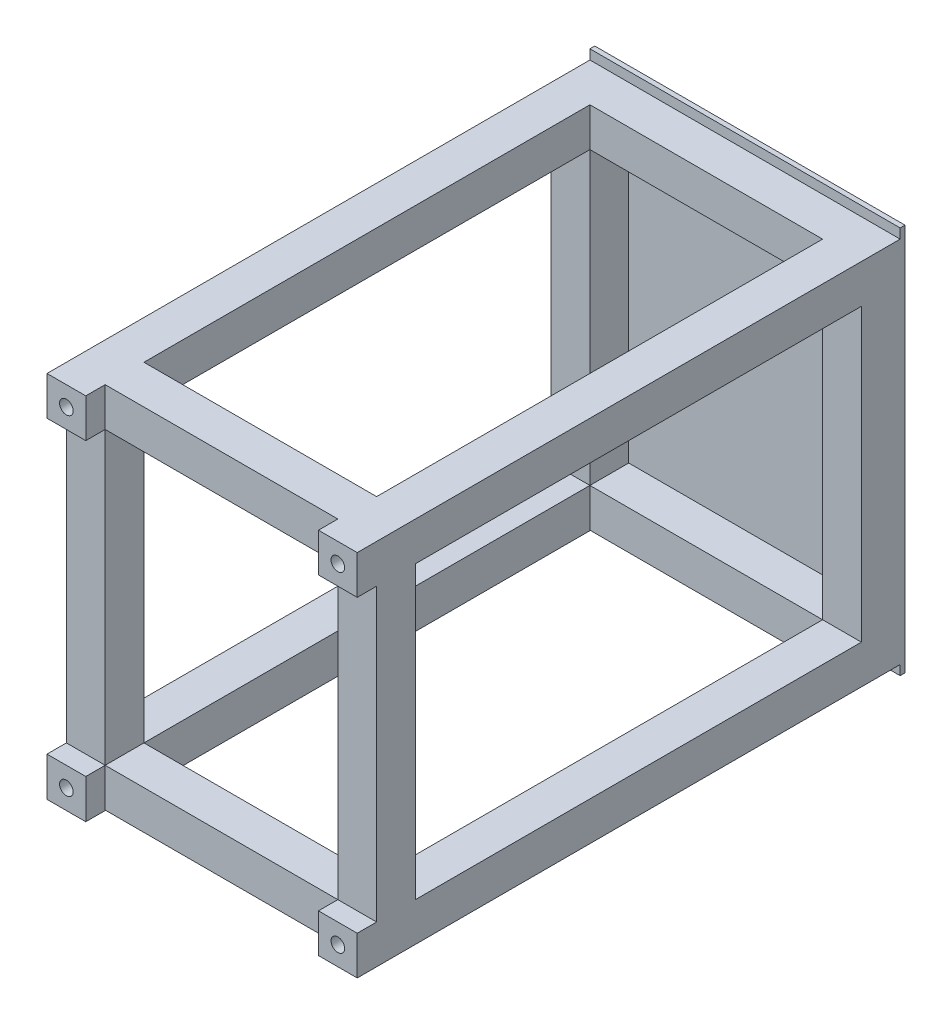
ISO-10303-21;
HEADER;
FILE_DESCRIPTION(('STEP AP214'),'2;1');
FILE_NAME('part.step','',(''),(''),'','','');
FILE_SCHEMA(('AUTOMOTIVE_DESIGN { 1 0 10303 214 1 1 1 1 }'));
ENDSEC;
DATA;
#1=APPLICATION_CONTEXT('core data for automotive mechanical design processes');
#2=APPLICATION_PROTOCOL_DEFINITION('international standard','automotive_design',2000,#1);
#3=PRODUCT_CONTEXT('',#1,'mechanical');
#4=PRODUCT('Part','Part','',(#3));
#5=PRODUCT_RELATED_PRODUCT_CATEGORY('part','',(#4));
#6=PRODUCT_DEFINITION_FORMATION('','',#4);
#7=PRODUCT_DEFINITION_CONTEXT('part definition',#1,'design');
#8=PRODUCT_DEFINITION('design','',#6,#7);
#9=PRODUCT_DEFINITION_SHAPE('','',#8);
#10=(LENGTH_UNIT() NAMED_UNIT(*) SI_UNIT(.MILLI.,.METRE.));
#11=(NAMED_UNIT(*) PLANE_ANGLE_UNIT() SI_UNIT($,.RADIAN.));
#12=(NAMED_UNIT(*) SI_UNIT($,.STERADIAN.) SOLID_ANGLE_UNIT());
#13=UNCERTAINTY_MEASURE_WITH_UNIT(LENGTH_MEASURE(1.E-05),#10,'distance_accuracy_value','');
#14=(GEOMETRIC_REPRESENTATION_CONTEXT(3) GLOBAL_UNCERTAINTY_ASSIGNED_CONTEXT((#13)) GLOBAL_UNIT_ASSIGNED_CONTEXT((#10,
#11,#12)) REPRESENTATION_CONTEXT('',''));
#15=CARTESIAN_POINT('',(0.,0.,0.));
#16=DIRECTION('',(0.,0.,1.));
#17=DIRECTION('',(1.,0.,0.));
#18=AXIS2_PLACEMENT_3D('',#15,#16,#17);
#19=CARTESIAN_POINT('',(-160.,150.,565.));
#20=DIRECTION('',(0.,1.,0.));
#21=DIRECTION('',(-1.,0.,0.));
#22=AXIS2_PLACEMENT_3D('',#19,#20,#21);
#23=PLANE('',#22);
#24=DIRECTION('',(-1.,0.,0.));
#25=VECTOR('',#24,1.);
#26=CARTESIAN_POINT('',(-160.,150.,545.));
#27=LINE('',#26,#25);
#28=CARTESIAN_POINT('',(-120.,150.,545.));
#29=VERTEX_POINT('',#28);
#30=CARTESIAN_POINT('',(-160.,150.,545.));
#31=VERTEX_POINT('',#30);
#32=EDGE_CURVE('E328',#29,#31,#27,.T.);
#33=ORIENTED_EDGE('',*,*,#32,.F.);
#34=DIRECTION('',(0.,0.,-1.));
#35=VECTOR('',#34,1.);
#36=CARTESIAN_POINT('',(-120.,150.,565.));
#37=LINE('',#36,#35);
#38=CARTESIAN_POINT('',(-120.,150.,565.));
#39=VERTEX_POINT('',#38);
#40=EDGE_CURVE('E497',#39,#29,#37,.T.);
#41=ORIENTED_EDGE('',*,*,#40,.F.);
#42=DIRECTION('',(1.,0.,0.));
#43=VECTOR('',#42,1.);
#44=CARTESIAN_POINT('',(-160.,150.,565.));
#45=LINE('',#44,#43);
#46=CARTESIAN_POINT('',(-160.,150.,565.));
#47=VERTEX_POINT('',#46);
#48=EDGE_CURVE('E486',#47,#39,#45,.T.);
#49=ORIENTED_EDGE('',*,*,#48,.F.);
#50=DIRECTION('',(0.,0.,-1.));
#51=VECTOR('',#50,1.);
#52=CARTESIAN_POINT('',(-160.,150.,565.));
#53=LINE('',#52,#51);
#54=EDGE_CURVE('E662',#47,#31,#53,.T.);
#55=ORIENTED_EDGE('',*,*,#54,.T.);
#56=EDGE_LOOP('',(#33,#41,#49,#55));
#57=FACE_BOUND('',#56,.T.);
#58=ADVANCED_FACE('F39',(#57),#23,.F.);
#59=DIRECTION('',(0.,0.,1.));
#60=VECTOR('',#59,1.);
#61=CARTESIAN_POINT('',(-120.,150.,565.));
#62=LINE('',#61,#60);
#63=CARTESIAN_POINT('',(-120.,150.,505.));
#64=VERTEX_POINT('',#63);
#65=EDGE_CURVE('E324',#64,#29,#62,.T.);
#66=ORIENTED_EDGE('',*,*,#65,.F.);
#67=DIRECTION('',(1.,0.,0.));
#68=VECTOR('',#67,1.);
#69=CARTESIAN_POINT('',(-120.,150.,505.));
#70=LINE('',#69,#68);
#71=CARTESIAN_POINT('',(120.,150.,505.));
#72=VERTEX_POINT('',#71);
#73=EDGE_CURVE('E398',#64,#72,#70,.T.);
#74=ORIENTED_EDGE('',*,*,#73,.T.);
#75=DIRECTION('',(0.,0.,-1.));
#76=VECTOR('',#75,1.);
#77=CARTESIAN_POINT('',(120.,150.,565.));
#78=LINE('',#77,#76);
#79=CARTESIAN_POINT('',(120.,150.,545.));
#80=VERTEX_POINT('',#79);
#81=EDGE_CURVE('E350',#80,#72,#78,.T.);
#82=ORIENTED_EDGE('',*,*,#81,.F.);
#83=DIRECTION('',(1.,0.,0.));
#84=VECTOR('',#83,1.);
#85=CARTESIAN_POINT('',(-120.,150.,545.));
#86=LINE('',#85,#84);
#87=EDGE_CURVE('E386',#29,#80,#86,.T.);
#88=ORIENTED_EDGE('',*,*,#87,.F.);
#89=EDGE_LOOP('',(#66,#74,#82,#88));
#90=FACE_BOUND('',#89,.T.);
#91=ADVANCED_FACE('F707',(#90),#23,.F.);
#92=CARTESIAN_POINT('',(120.,-150.,565.));
#93=DIRECTION('',(0.,-1.,0.));
#94=DIRECTION('',(0.,0.,-1.));
#95=AXIS2_PLACEMENT_3D('',#92,#93,#94);
#96=PLANE('',#95);
#97=DIRECTION('',(1.,0.,0.));
#98=VECTOR('',#97,1.);
#99=CARTESIAN_POINT('',(120.,-150.,545.));
#100=LINE('',#99,#98);
#101=CARTESIAN_POINT('',(-160.,-150.,545.));
#102=VERTEX_POINT('',#101);
#103=CARTESIAN_POINT('',(-120.,-150.,545.));
#104=VERTEX_POINT('',#103);
#105=EDGE_CURVE('E326',#102,#104,#100,.T.);
#106=ORIENTED_EDGE('',*,*,#105,.F.);
#107=DIRECTION('',(0.,0.,-1.));
#108=VECTOR('',#107,1.);
#109=CARTESIAN_POINT('',(-160.,-150.,565.));
#110=LINE('',#109,#108);
#111=CARTESIAN_POINT('',(-160.,-150.,565.));
#112=VERTEX_POINT('',#111);
#113=EDGE_CURVE('E422',#112,#102,#110,.T.);
#114=ORIENTED_EDGE('',*,*,#113,.F.);
#115=DIRECTION('',(-1.,0.,0.));
#116=VECTOR('',#115,1.);
#117=CARTESIAN_POINT('',(-160.,-150.,565.));
#118=LINE('',#117,#116);
#119=CARTESIAN_POINT('',(-120.,-150.,565.));
#120=VERTEX_POINT('',#119);
#121=EDGE_CURVE('E415',#120,#112,#118,.T.);
#122=ORIENTED_EDGE('',*,*,#121,.F.);
#123=DIRECTION('',(0.,0.,-1.));
#124=VECTOR('',#123,1.);
#125=CARTESIAN_POINT('',(-120.,-150.,565.));
#126=LINE('',#125,#124);
#127=EDGE_CURVE('E426',#120,#104,#126,.T.);
#128=ORIENTED_EDGE('',*,*,#127,.T.);
#129=EDGE_LOOP('',(#106,#114,#122,#128));
#130=FACE_BOUND('',#129,.T.);
#131=ADVANCED_FACE('F657',(#130),#96,.F.);
#132=DIRECTION('',(0.,0.,-1.));
#133=VECTOR('',#132,1.);
#134=CARTESIAN_POINT('',(-120.,-150.,565.));
#135=LINE('',#134,#133);
#136=CARTESIAN_POINT('',(-120.,-150.,505.));
#137=VERTEX_POINT('',#136);
#138=EDGE_CURVE('E318',#104,#137,#135,.T.);
#139=ORIENTED_EDGE('',*,*,#138,.F.);
#140=DIRECTION('',(-1.,0.,0.));
#141=VECTOR('',#140,1.);
#142=CARTESIAN_POINT('',(-120.,-150.,545.));
#143=LINE('',#142,#141);
#144=CARTESIAN_POINT('',(120.,-150.,545.));
#145=VERTEX_POINT('',#144);
#146=EDGE_CURVE('E365',#145,#104,#143,.T.);
#147=ORIENTED_EDGE('',*,*,#146,.F.);
#148=DIRECTION('',(0.,0.,1.));
#149=VECTOR('',#148,1.);
#150=CARTESIAN_POINT('',(120.,-150.,565.));
#151=LINE('',#150,#149);
#152=CARTESIAN_POINT('',(120.,-150.,505.));
#153=VERTEX_POINT('',#152);
#154=EDGE_CURVE('E343',#153,#145,#151,.T.);
#155=ORIENTED_EDGE('',*,*,#154,.F.);
#156=DIRECTION('',(-1.,0.,0.));
#157=VECTOR('',#156,1.);
#158=CARTESIAN_POINT('',(-120.,-150.,505.));
#159=LINE('',#158,#157);
#160=EDGE_CURVE('E376',#153,#137,#159,.T.);
#161=ORIENTED_EDGE('',*,*,#160,.T.);
#162=EDGE_LOOP('',(#139,#147,#155,#161));
#163=FACE_BOUND('',#162,.T.);
#164=ADVANCED_FACE('F705',(#163),#96,.F.);
#165=CARTESIAN_POINT('',(-120.,150.,45.));
#166=VERTEX_POINT('',#165);
#167=EDGE_CURVE('E507',#64,#166,#37,.T.);
#168=ORIENTED_EDGE('',*,*,#167,.F.);
#169=DIRECTION('',(-1.,0.,0.));
#170=VECTOR('',#169,1.);
#171=CARTESIAN_POINT('',(-160.,150.,505.));
#172=LINE('',#171,#170);
#173=CARTESIAN_POINT('',(-160.,150.,505.));
#174=VERTEX_POINT('',#173);
#175=EDGE_CURVE('E333',#64,#174,#172,.T.);
#176=ORIENTED_EDGE('',*,*,#175,.T.);
#177=CARTESIAN_POINT('',(-160.,150.,45.));
#178=VERTEX_POINT('',#177);
#179=EDGE_CURVE('E43',#174,#178,#53,.T.);
#180=ORIENTED_EDGE('',*,*,#179,.T.);
#181=DIRECTION('',(1.,0.,0.));
#182=VECTOR('',#181,1.);
#183=CARTESIAN_POINT('',(-160.,150.,45.));
#184=LINE('',#183,#182);
#185=EDGE_CURVE('E482',#178,#166,#184,.T.);
#186=ORIENTED_EDGE('',*,*,#185,.T.);
#187=EDGE_LOOP('',(#168,#176,#180,#186));
#188=FACE_BOUND('',#187,.T.);
#189=ADVANCED_FACE('F702',(#188),#23,.F.);
#190=DIRECTION('',(1.,0.,0.));
#191=VECTOR('',#190,1.);
#192=CARTESIAN_POINT('',(-160.,150.,505.));
#193=LINE('',#192,#191);
#194=CARTESIAN_POINT('',(160.,150.,505.));
#195=VERTEX_POINT('',#194);
#196=EDGE_CURVE('E353',#72,#195,#193,.T.);
#197=ORIENTED_EDGE('',*,*,#196,.F.);
#198=DIRECTION('',(0.,0.,-1.));
#199=VECTOR('',#198,1.);
#200=CARTESIAN_POINT('',(120.,150.,565.));
#201=LINE('',#200,#199);
#202=CARTESIAN_POINT('',(120.,150.,45.));
#203=VERTEX_POINT('',#202);
#204=EDGE_CURVE('E479',#72,#203,#201,.T.);
#205=ORIENTED_EDGE('',*,*,#204,.T.);
#206=DIRECTION('',(1.,0.,0.));
#207=VECTOR('',#206,1.);
#208=CARTESIAN_POINT('',(120.,150.,45.));
#209=LINE('',#208,#207);
#210=CARTESIAN_POINT('',(160.,150.,45.));
#211=VERTEX_POINT('',#210);
#212=EDGE_CURVE('E461',#203,#211,#209,.T.);
#213=ORIENTED_EDGE('',*,*,#212,.T.);
#214=DIRECTION('',(0.,0.,-1.));
#215=VECTOR('',#214,1.);
#216=CARTESIAN_POINT('',(160.,150.,565.));
#217=LINE('',#216,#215);
#218=EDGE_CURVE('E476',#195,#211,#217,.T.);
#219=ORIENTED_EDGE('',*,*,#218,.F.);
#220=EDGE_LOOP('',(#197,#205,#213,#219));
#221=FACE_BOUND('',#220,.T.);
#222=ADVANCED_FACE('F704',(#221),#23,.F.);
#223=CARTESIAN_POINT('',(-160.,-150.,505.));
#224=VERTEX_POINT('',#223);
#225=CARTESIAN_POINT('',(-160.,-150.,45.));
#226=VERTEX_POINT('',#225);
#227=EDGE_CURVE('E417',#224,#226,#110,.T.);
#228=ORIENTED_EDGE('',*,*,#227,.F.);
#229=DIRECTION('',(1.,0.,0.));
#230=VECTOR('',#229,1.);
#231=CARTESIAN_POINT('',(120.,-150.,505.));
#232=LINE('',#231,#230);
#233=EDGE_CURVE('E330',#224,#137,#232,.T.);
#234=ORIENTED_EDGE('',*,*,#233,.T.);
#235=CARTESIAN_POINT('',(-120.,-150.,45.));
#236=VERTEX_POINT('',#235);
#237=EDGE_CURVE('E425',#137,#236,#126,.T.);
#238=ORIENTED_EDGE('',*,*,#237,.T.);
#239=DIRECTION('',(-1.,0.,0.));
#240=VECTOR('',#239,1.);
#241=CARTESIAN_POINT('',(-160.,-150.,45.));
#242=LINE('',#241,#240);
#243=EDGE_CURVE('E410',#236,#226,#242,.T.);
#244=ORIENTED_EDGE('',*,*,#243,.T.);
#245=EDGE_LOOP('',(#228,#234,#238,#244));
#246=FACE_BOUND('',#245,.T.);
#247=ADVANCED_FACE('F712',(#246),#96,.F.);
#248=DIRECTION('',(-1.,0.,0.));
#249=VECTOR('',#248,1.);
#250=CARTESIAN_POINT('',(120.,-150.,505.));
#251=LINE('',#250,#249);
#252=CARTESIAN_POINT('',(160.,-150.,505.));
#253=VERTEX_POINT('',#252);
#254=EDGE_CURVE('E49',#253,#153,#251,.T.);
#255=ORIENTED_EDGE('',*,*,#254,.F.);
#256=DIRECTION('',(0.,0.,-1.));
#257=VECTOR('',#256,1.);
#258=CARTESIAN_POINT('',(160.,-150.,565.));
#259=LINE('',#258,#257);
#260=CARTESIAN_POINT('',(160.,-150.,45.));
#261=VERTEX_POINT('',#260);
#262=EDGE_CURVE('E449',#253,#261,#259,.T.);
#263=ORIENTED_EDGE('',*,*,#262,.T.);
#264=DIRECTION('',(-1.,0.,0.));
#265=VECTOR('',#264,1.);
#266=CARTESIAN_POINT('',(120.,-150.,45.));
#267=LINE('',#266,#265);
#268=CARTESIAN_POINT('',(120.,-150.,45.));
#269=VERTEX_POINT('',#268);
#270=EDGE_CURVE('E434',#261,#269,#267,.T.);
#271=ORIENTED_EDGE('',*,*,#270,.T.);
#272=DIRECTION('',(0.,0.,-1.));
#273=VECTOR('',#272,1.);
#274=CARTESIAN_POINT('',(120.,-150.,565.));
#275=LINE('',#274,#273);
#276=EDGE_CURVE('E441',#153,#269,#275,.T.);
#277=ORIENTED_EDGE('',*,*,#276,.F.);
#278=EDGE_LOOP('',(#255,#263,#271,#277));
#279=FACE_BOUND('',#278,.T.);
#280=ADVANCED_FACE('F765',(#279),#96,.F.);
#281=CARTESIAN_POINT('',(120.,-150.,565.));
#282=DIRECTION('',(1.,0.,0.));
#283=DIRECTION('',(0.,1.,0.));
#284=AXIS2_PLACEMENT_3D('',#281,#282,#283);
#285=PLANE('',#284);
#286=DIRECTION('',(0.,1.,0.));
#287=VECTOR('',#286,1.);
#288=CARTESIAN_POINT('',(120.,-190.,505.));
#289=LINE('',#288,#287);
#290=CARTESIAN_POINT('',(120.,-190.,505.));
#291=VERTEX_POINT('',#290);
#292=EDGE_CURVE('E373',#291,#153,#289,.T.);
#293=ORIENTED_EDGE('',*,*,#292,.T.);
#294=ORIENTED_EDGE('',*,*,#276,.T.);
#295=DIRECTION('',(0.,-1.,0.));
#296=VECTOR('',#295,1.);
#297=CARTESIAN_POINT('',(120.,-150.,45.));
#298=LINE('',#297,#296);
#299=CARTESIAN_POINT('',(120.,-190.,45.));
#300=VERTEX_POINT('',#299);
#301=EDGE_CURVE('E429',#269,#300,#298,.T.);
#302=ORIENTED_EDGE('',*,*,#301,.T.);
#303=DIRECTION('',(0.,0.,-1.));
#304=VECTOR('',#303,1.);
#305=CARTESIAN_POINT('',(120.,-190.,565.));
#306=LINE('',#305,#304);
#307=EDGE_CURVE('E452',#291,#300,#306,.T.);
#308=ORIENTED_EDGE('',*,*,#307,.F.);
#309=EDGE_LOOP('',(#293,#294,#302,#308));
#310=FACE_BOUND('',#309,.T.);
#311=ADVANCED_FACE('F762',(#310),#285,.F.);
#312=CARTESIAN_POINT('',(-120.,190.,565.));
#313=DIRECTION('',(-1.,0.,0.));
#314=DIRECTION('',(0.,0.,1.));
#315=AXIS2_PLACEMENT_3D('',#312,#313,#314);
#316=PLANE('',#315);
#317=DIRECTION('',(0.,-1.,0.));
#318=VECTOR('',#317,1.);
#319=CARTESIAN_POINT('',(-120.,190.,505.));
#320=LINE('',#319,#318);
#321=CARTESIAN_POINT('',(-120.,190.,505.));
#322=VERTEX_POINT('',#321);
#323=EDGE_CURVE('E382',#322,#64,#320,.T.);
#324=ORIENTED_EDGE('',*,*,#323,.T.);
#325=ORIENTED_EDGE('',*,*,#167,.T.);
#326=DIRECTION('',(0.,1.,0.));
#327=VECTOR('',#326,1.);
#328=CARTESIAN_POINT('',(-120.,190.,45.));
#329=LINE('',#328,#327);
#330=CARTESIAN_POINT('',(-120.,190.,45.));
#331=VERTEX_POINT('',#330);
#332=EDGE_CURVE('E487',#166,#331,#329,.T.);
#333=ORIENTED_EDGE('',*,*,#332,.T.);
#334=DIRECTION('',(0.,0.,-1.));
#335=VECTOR('',#334,1.);
#336=CARTESIAN_POINT('',(-120.,190.,565.));
#337=LINE('',#336,#335);
#338=EDGE_CURVE('E494',#322,#331,#337,.T.);
#339=ORIENTED_EDGE('',*,*,#338,.F.);
#340=EDGE_LOOP('',(#324,#325,#333,#339));
#341=FACE_BOUND('',#340,.T.);
#342=ADVANCED_FACE('F679',(#341),#316,.F.);
#343=CARTESIAN_POINT('',(120.,150.,565.));
#344=DIRECTION('',(1.,0.,0.));
#345=DIRECTION('',(0.,0.,-1.));
#346=AXIS2_PLACEMENT_3D('',#343,#344,#345);
#347=PLANE('',#346);
#348=DIRECTION('',(0.,1.,0.));
#349=VECTOR('',#348,1.);
#350=CARTESIAN_POINT('',(120.,190.,505.));
#351=LINE('',#350,#349);
#352=CARTESIAN_POINT('',(120.,190.,505.));
#353=VERTEX_POINT('',#352);
#354=EDGE_CURVE('E401',#72,#353,#351,.T.);
#355=ORIENTED_EDGE('',*,*,#354,.T.);
#356=DIRECTION('',(0.,0.,-1.));
#357=VECTOR('',#356,1.);
#358=CARTESIAN_POINT('',(120.,190.,565.));
#359=LINE('',#358,#357);
#360=CARTESIAN_POINT('',(120.,190.,45.));
#361=VERTEX_POINT('',#360);
#362=EDGE_CURVE('E468',#353,#361,#359,.T.);
#363=ORIENTED_EDGE('',*,*,#362,.T.);
#364=DIRECTION('',(0.,-1.,0.));
#365=VECTOR('',#364,1.);
#366=CARTESIAN_POINT('',(120.,150.,45.));
#367=LINE('',#366,#365);
#368=EDGE_CURVE('E456',#361,#203,#367,.T.);
#369=ORIENTED_EDGE('',*,*,#368,.T.);
#370=ORIENTED_EDGE('',*,*,#204,.F.);
#371=EDGE_LOOP('',(#355,#363,#369,#370));
#372=FACE_BOUND('',#371,.T.);
#373=ADVANCED_FACE('F820',(#372),#347,.F.);
#374=CARTESIAN_POINT('',(0.,0.,45.));
#375=DIRECTION('',(0.,0.,1.));
#376=DIRECTION('',(1.,0.,0.));
#377=AXIS2_PLACEMENT_3D('',#374,#375,#376);
#378=PLANE('',#377);
#379=DIRECTION('',(-1.,0.,0.));
#380=VECTOR('',#379,1.);
#381=CARTESIAN_POINT('',(-120.,-150.,45.));
#382=LINE('',#381,#380);
#383=EDGE_CURVE('E568',#269,#236,#382,.T.);
#384=ORIENTED_EDGE('',*,*,#383,.T.);
#385=DIRECTION('',(0.,1.,0.));
#386=VECTOR('',#385,1.);
#387=CARTESIAN_POINT('',(-120.,-190.450216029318,45.));
#388=LINE('',#387,#386);
#389=CARTESIAN_POINT('',(-120.,-190.,45.));
#390=VERTEX_POINT('',#389);
#391=EDGE_CURVE('E395',#390,#236,#388,.T.);
#392=ORIENTED_EDGE('',*,*,#391,.F.);
#393=DIRECTION('',(1.,0.,0.));
#394=VECTOR('',#393,1.);
#395=CARTESIAN_POINT('',(-120.,-190.,45.));
#396=LINE('',#395,#394);
#397=EDGE_CURVE('E565',#390,#300,#396,.T.);
#398=ORIENTED_EDGE('',*,*,#397,.T.);
#399=ORIENTED_EDGE('',*,*,#301,.F.);
#400=EDGE_LOOP('',(#384,#392,#398,#399));
#401=FACE_BOUND('',#400,.T.);
#402=ADVANCED_FACE('F860',(#401),#378,.T.);
#403=DIRECTION('',(0.,-1.,0.));
#404=VECTOR('',#403,1.);
#405=CARTESIAN_POINT('',(-160.,190.,45.));
#406=LINE('',#405,#404);
#407=EDGE_CURVE('E532',#178,#226,#406,.T.);
#408=ORIENTED_EDGE('',*,*,#407,.T.);
#409=ORIENTED_EDGE('',*,*,#243,.F.);
#410=DIRECTION('',(0.,1.,0.));
#411=VECTOR('',#410,1.);
#412=CARTESIAN_POINT('',(-120.,190.,45.));
#413=LINE('',#412,#411);
#414=EDGE_CURVE('E537',#236,#166,#413,.T.);
#415=ORIENTED_EDGE('',*,*,#414,.T.);
#416=ORIENTED_EDGE('',*,*,#185,.F.);
#417=EDGE_LOOP('',(#408,#409,#415,#416));
#418=FACE_BOUND('',#417,.T.);
#419=ADVANCED_FACE('F694',(#418),#378,.T.);
#420=DIRECTION('',(0.,-1.,0.));
#421=VECTOR('',#420,1.);
#422=CARTESIAN_POINT('',(120.,190.,45.));
#423=LINE('',#422,#421);
#424=EDGE_CURVE('E553',#203,#269,#423,.T.);
#425=ORIENTED_EDGE('',*,*,#424,.T.);
#426=ORIENTED_EDGE('',*,*,#270,.F.);
#427=DIRECTION('',(0.,1.,0.));
#428=VECTOR('',#427,1.);
#429=CARTESIAN_POINT('',(160.,190.,45.));
#430=LINE('',#429,#428);
#431=EDGE_CURVE('E556',#261,#211,#430,.T.);
#432=ORIENTED_EDGE('',*,*,#431,.T.);
#433=ORIENTED_EDGE('',*,*,#212,.F.);
#434=EDGE_LOOP('',(#425,#426,#432,#433));
#435=FACE_BOUND('',#434,.T.);
#436=ADVANCED_FACE('F770',(#435),#378,.T.);
#437=DIRECTION('',(1.,0.,0.));
#438=VECTOR('',#437,1.);
#439=CARTESIAN_POINT('',(-120.,150.,45.));
#440=LINE('',#439,#438);
#441=EDGE_CURVE('E585',#166,#203,#440,.T.);
#442=ORIENTED_EDGE('',*,*,#441,.T.);
#443=ORIENTED_EDGE('',*,*,#368,.F.);
#444=DIRECTION('',(-1.,0.,0.));
#445=VECTOR('',#444,1.);
#446=CARTESIAN_POINT('',(-120.,190.,45.));
#447=LINE('',#446,#445);
#448=EDGE_CURVE('E510',#361,#331,#447,.T.);
#449=ORIENTED_EDGE('',*,*,#448,.T.);
#450=ORIENTED_EDGE('',*,*,#332,.F.);
#451=EDGE_LOOP('',(#442,#443,#449,#450));
#452=FACE_BOUND('',#451,.T.);
#453=ADVANCED_FACE('F700',(#452),#378,.T.);
#454=CARTESIAN_POINT('',(0.,0.,5.));
#455=DIRECTION('',(0.,0.,1.));
#456=DIRECTION('',(1.,0.,0.));
#457=AXIS2_PLACEMENT_3D('',#454,#455,#456);
#458=PLANE('',#457);
#459=DIRECTION('',(1.,0.,0.));
#460=VECTOR('',#459,1.);
#461=CARTESIAN_POINT('',(-120.,150.,5.));
#462=LINE('',#461,#460);
#463=CARTESIAN_POINT('',(-120.,150.,5.));
#464=VERTEX_POINT('',#463);
#465=CARTESIAN_POINT('',(120.,150.,5.));
#466=VERTEX_POINT('',#465);
#467=EDGE_CURVE('E584',#464,#466,#462,.T.);
#468=ORIENTED_EDGE('',*,*,#467,.F.);
#469=DIRECTION('',(0.,1.,0.));
#470=VECTOR('',#469,1.);
#471=CARTESIAN_POINT('',(-120.,190.,5.));
#472=LINE('',#471,#470);
#473=CARTESIAN_POINT('',(-120.,-150.,5.));
#474=VERTEX_POINT('',#473);
#475=EDGE_CURVE('E544',#474,#464,#472,.T.);
#476=ORIENTED_EDGE('',*,*,#475,.F.);
#477=DIRECTION('',(-1.,0.,0.));
#478=VECTOR('',#477,1.);
#479=CARTESIAN_POINT('',(-120.,-150.,5.));
#480=LINE('',#479,#478);
#481=CARTESIAN_POINT('',(120.,-150.,5.));
#482=VERTEX_POINT('',#481);
#483=EDGE_CURVE('E569',#482,#474,#480,.T.);
#484=ORIENTED_EDGE('',*,*,#483,.F.);
#485=DIRECTION('',(0.,-1.,0.));
#486=VECTOR('',#485,1.);
#487=CARTESIAN_POINT('',(120.,190.,5.));
#488=LINE('',#487,#486);
#489=EDGE_CURVE('E552',#466,#482,#488,.T.);
#490=ORIENTED_EDGE('',*,*,#489,.F.);
#491=EDGE_LOOP('',(#468,#476,#484,#490));
#492=FACE_BOUND('',#491,.T.);
#493=ADVANCED_FACE('F849',(#492),#458,.T.);
#494=DIRECTION('',(0.,-1.,0.));
#495=VECTOR('',#494,1.);
#496=CARTESIAN_POINT('',(-160.,200.,5.));
#497=LINE('',#496,#495);
#498=CARTESIAN_POINT('',(-160.,200.,5.));
#499=VERTEX_POINT('',#498);
#500=CARTESIAN_POINT('',(-160.,190.,5.));
#501=VERTEX_POINT('',#500);
#502=EDGE_CURVE('E607',#499,#501,#497,.T.);
#503=ORIENTED_EDGE('',*,*,#502,.T.);
#504=DIRECTION('',(-1.,0.,0.));
#505=VECTOR('',#504,1.);
#506=CARTESIAN_POINT('',(-120.,190.,5.));
#507=LINE('',#506,#505);
#508=CARTESIAN_POINT('',(160.,190.,5.));
#509=VERTEX_POINT('',#508);
#510=EDGE_CURVE('E587',#509,#501,#507,.T.);
#511=ORIENTED_EDGE('',*,*,#510,.F.);
#512=DIRECTION('',(0.,1.,0.));
#513=VECTOR('',#512,1.);
#514=CARTESIAN_POINT('',(160.,200.,5.));
#515=LINE('',#514,#513);
#516=CARTESIAN_POINT('',(160.,200.,5.));
#517=VERTEX_POINT('',#516);
#518=EDGE_CURVE('E604',#509,#517,#515,.T.);
#519=ORIENTED_EDGE('',*,*,#518,.T.);
#520=DIRECTION('',(-1.,0.,0.));
#521=VECTOR('',#520,1.);
#522=CARTESIAN_POINT('',(-160.,200.,5.));
#523=LINE('',#522,#521);
#524=EDGE_CURVE('E603',#517,#499,#523,.T.);
#525=ORIENTED_EDGE('',*,*,#524,.T.);
#526=EDGE_LOOP('',(#503,#511,#519,#525));
#527=FACE_BOUND('',#526,.T.);
#528=ADVANCED_FACE('F834',(#527),#458,.T.);
#529=DIRECTION('',(1.,0.,0.));
#530=VECTOR('',#529,1.);
#531=CARTESIAN_POINT('',(-120.,-190.,5.));
#532=LINE('',#531,#530);
#533=CARTESIAN_POINT('',(-120.,-190.,5.));
#534=VERTEX_POINT('',#533);
#535=CARTESIAN_POINT('',(160.,-190.,5.));
#536=VERTEX_POINT('',#535);
#537=EDGE_CURVE('E564',#534,#536,#532,.T.);
#538=ORIENTED_EDGE('',*,*,#537,.F.);
#539=CARTESIAN_POINT('',(-120.,-190.450216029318,5.));
#540=VERTEX_POINT('',#539);
#541=EDGE_CURVE('E541',#540,#534,#472,.T.);
#542=ORIENTED_EDGE('',*,*,#541,.F.);
#543=DIRECTION('',(1.,0.,0.));
#544=VECTOR('',#543,1.);
#545=CARTESIAN_POINT('',(-120.,-190.450216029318,5.));
#546=LINE('',#545,#544);
#547=CARTESIAN_POINT('',(-160.,-190.450216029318,5.));
#548=VERTEX_POINT('',#547);
#549=EDGE_CURVE('E543',#548,#540,#546,.T.);
#550=ORIENTED_EDGE('',*,*,#549,.F.);
#551=CARTESIAN_POINT('',(-160.,-200.,5.));
#552=VERTEX_POINT('',#551);
#553=EDGE_CURVE('E606',#548,#552,#497,.T.);
#554=ORIENTED_EDGE('',*,*,#553,.T.);
#555=DIRECTION('',(1.,0.,0.));
#556=VECTOR('',#555,1.);
#557=CARTESIAN_POINT('',(-160.,-200.,5.));
#558=LINE('',#557,#556);
#559=CARTESIAN_POINT('',(160.,-200.,5.));
#560=VERTEX_POINT('',#559);
#561=EDGE_CURVE('E610',#552,#560,#558,.T.);
#562=ORIENTED_EDGE('',*,*,#561,.T.);
#563=EDGE_CURVE('E600',#560,#536,#515,.T.);
#564=ORIENTED_EDGE('',*,*,#563,.T.);
#565=EDGE_LOOP('',(#538,#542,#550,#554,#562,#564));
#566=FACE_BOUND('',#565,.T.);
#567=ADVANCED_FACE('F641',(#566),#458,.T.);
#568=CARTESIAN_POINT('',(160.,200.,5.));
#569=DIRECTION('',(-1.,0.,0.));
#570=DIRECTION('',(0.,-1.,0.));
#571=AXIS2_PLACEMENT_3D('',#568,#569,#570);
#572=PLANE('',#571);
#573=CARTESIAN_POINT('',(160.,150.,565.));
#574=VERTEX_POINT('',#573);
#575=CARTESIAN_POINT('',(160.,150.,545.));
#576=VERTEX_POINT('',#575);
#577=EDGE_CURVE('E477',#574,#576,#217,.T.);
#578=ORIENTED_EDGE('',*,*,#577,.T.);
#579=DIRECTION('',(0.,1.,0.));
#580=VECTOR('',#579,1.);
#581=CARTESIAN_POINT('',(160.,190.,545.));
#582=LINE('',#581,#580);
#583=CARTESIAN_POINT('',(160.,-150.,545.));
#584=VERTEX_POINT('',#583);
#585=EDGE_CURVE('E339',#584,#576,#582,.T.);
#586=ORIENTED_EDGE('',*,*,#585,.F.);
#587=CARTESIAN_POINT('',(160.,-150.,565.));
#588=VERTEX_POINT('',#587);
#589=EDGE_CURVE('E450',#588,#584,#259,.T.);
#590=ORIENTED_EDGE('',*,*,#589,.F.);
#591=DIRECTION('',(0.,1.,0.));
#592=VECTOR('',#591,1.);
#593=CARTESIAN_POINT('',(160.,-150.,565.));
#594=LINE('',#593,#592);
#595=CARTESIAN_POINT('',(160.,-190.,565.));
#596=VERTEX_POINT('',#595);
#597=EDGE_CURVE('E437',#596,#588,#594,.T.);
#598=ORIENTED_EDGE('',*,*,#597,.F.);
#599=DIRECTION('',(0.,0.,-1.));
#600=VECTOR('',#599,1.);
#601=CARTESIAN_POINT('',(160.,-190.,45.));
#602=LINE('',#601,#600);
#603=EDGE_CURVE('E562',#596,#536,#602,.T.);
#604=ORIENTED_EDGE('',*,*,#603,.T.);
#605=ORIENTED_EDGE('',*,*,#563,.F.);
#606=DIRECTION('',(0.,0.,-1.));
#607=VECTOR('',#606,1.);
#608=CARTESIAN_POINT('',(160.,-200.,5.));
#609=LINE('',#608,#607);
#610=CARTESIAN_POINT('',(160.,-200.,0.));
#611=VERTEX_POINT('',#610);
#612=EDGE_CURVE('E612',#560,#611,#609,.T.);
#613=ORIENTED_EDGE('',*,*,#612,.T.);
#614=DIRECTION('',(0.,1.,0.));
#615=VECTOR('',#614,1.);
#616=CARTESIAN_POINT('',(160.,200.,0.));
#617=LINE('',#616,#615);
#618=CARTESIAN_POINT('',(160.,200.,0.));
#619=VERTEX_POINT('',#618);
#620=EDGE_CURVE('E599',#611,#619,#617,.T.);
#621=ORIENTED_EDGE('',*,*,#620,.T.);
#622=DIRECTION('',(0.,0.,-1.));
#623=VECTOR('',#622,1.);
#624=CARTESIAN_POINT('',(160.,200.,5.));
#625=LINE('',#624,#623);
#626=EDGE_CURVE('E516',#517,#619,#625,.T.);
#627=ORIENTED_EDGE('',*,*,#626,.F.);
#628=ORIENTED_EDGE('',*,*,#518,.F.);
#629=DIRECTION('',(0.,0.,-1.));
#630=VECTOR('',#629,1.);
#631=CARTESIAN_POINT('',(160.,190.,45.));
#632=LINE('',#631,#630);
#633=CARTESIAN_POINT('',(160.,190.,565.));
#634=VERTEX_POINT('',#633);
#635=EDGE_CURVE('E559',#634,#509,#632,.T.);
#636=ORIENTED_EDGE('',*,*,#635,.F.);
#637=DIRECTION('',(0.,1.,0.));
#638=VECTOR('',#637,1.);
#639=CARTESIAN_POINT('',(160.,150.,565.));
#640=LINE('',#639,#638);
#641=EDGE_CURVE('E463',#574,#634,#640,.T.);
#642=ORIENTED_EDGE('',*,*,#641,.F.);
#643=EDGE_LOOP('',(#578,#586,#590,#598,#604,#605,#613,#621,#627,#628,#636,#642));
#644=FACE_BOUND('',#643,.T.);
#645=ORIENTED_EDGE('',*,*,#262,.F.);
#646=DIRECTION('',(0.,1.,0.));
#647=VECTOR('',#646,1.);
#648=CARTESIAN_POINT('',(160.,190.,505.));
#649=LINE('',#648,#647);
#650=EDGE_CURVE('E340',#253,#195,#649,.T.);
#651=ORIENTED_EDGE('',*,*,#650,.T.);
#652=ORIENTED_EDGE('',*,*,#218,.T.);
#653=ORIENTED_EDGE('',*,*,#431,.F.);
#654=EDGE_LOOP('',(#645,#651,#652,#653));
#655=FACE_BOUND('',#654,.T.);
#656=ADVANCED_FACE('F41',(#644,#655),#572,.F.);
#657=CARTESIAN_POINT('',(-160.,200.,5.));
#658=DIRECTION('',(0.,-1.,0.));
#659=DIRECTION('',(0.,0.,-1.));
#660=AXIS2_PLACEMENT_3D('',#657,#658,#659);
#661=PLANE('',#660);
#662=DIRECTION('',(-1.,0.,0.));
#663=VECTOR('',#662,1.);
#664=CARTESIAN_POINT('',(-160.,200.,0.));
#665=LINE('',#664,#663);
#666=CARTESIAN_POINT('',(-160.,200.,0.));
#667=VERTEX_POINT('',#666);
#668=EDGE_CURVE('E614',#619,#667,#665,.T.);
#669=ORIENTED_EDGE('',*,*,#668,.T.);
#670=DIRECTION('',(0.,0.,-1.));
#671=VECTOR('',#670,1.);
#672=CARTESIAN_POINT('',(-160.,200.,5.));
#673=LINE('',#672,#671);
#674=EDGE_CURVE('E521',#499,#667,#673,.T.);
#675=ORIENTED_EDGE('',*,*,#674,.F.);
#676=ORIENTED_EDGE('',*,*,#524,.F.);
#677=ORIENTED_EDGE('',*,*,#626,.T.);
#678=EDGE_LOOP('',(#669,#675,#676,#677));
#679=FACE_BOUND('',#678,.T.);
#680=ADVANCED_FACE('F836',(#679),#661,.F.);
#681=CARTESIAN_POINT('',(-160.,200.,5.));
#682=DIRECTION('',(1.,0.,0.));
#683=DIRECTION('',(0.,1.,0.));
#684=AXIS2_PLACEMENT_3D('',#681,#682,#683);
#685=PLANE('',#684);
#686=ORIENTED_EDGE('',*,*,#179,.F.);
#687=DIRECTION('',(0.,-1.,0.));
#688=VECTOR('',#687,1.);
#689=CARTESIAN_POINT('',(-160.,190.,505.));
#690=LINE('',#689,#688);
#691=EDGE_CURVE('E56',#174,#224,#690,.T.);
#692=ORIENTED_EDGE('',*,*,#691,.T.);
#693=ORIENTED_EDGE('',*,*,#227,.T.);
#694=ORIENTED_EDGE('',*,*,#407,.F.);
#695=EDGE_LOOP('',(#686,#692,#693,#694));
#696=FACE_BOUND('',#695,.T.);
#697=ORIENTED_EDGE('',*,*,#553,.F.);
#698=DIRECTION('',(0.,0.,-1.));
#699=VECTOR('',#698,1.);
#700=CARTESIAN_POINT('',(-160.,-190.450216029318,45.));
#701=LINE('',#700,#699);
#702=CARTESIAN_POINT('',(-160.,-190.450216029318,565.));
#703=VERTEX_POINT('',#702);
#704=EDGE_CURVE('E548',#703,#548,#701,.T.);
#705=ORIENTED_EDGE('',*,*,#704,.F.);
#706=DIRECTION('',(0.,-1.,0.));
#707=VECTOR('',#706,1.);
#708=CARTESIAN_POINT('',(-160.,-190.450216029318,565.));
#709=LINE('',#708,#707);
#710=EDGE_CURVE('E406',#112,#703,#709,.T.);
#711=ORIENTED_EDGE('',*,*,#710,.F.);
#712=ORIENTED_EDGE('',*,*,#113,.T.);
#713=DIRECTION('',(0.,-1.,0.));
#714=VECTOR('',#713,1.);
#715=CARTESIAN_POINT('',(-160.,190.,545.));
#716=LINE('',#715,#714);
#717=EDGE_CURVE('E316',#31,#102,#716,.T.);
#718=ORIENTED_EDGE('',*,*,#717,.F.);
#719=ORIENTED_EDGE('',*,*,#54,.F.);
#720=DIRECTION('',(0.,-1.,0.));
#721=VECTOR('',#720,1.);
#722=CARTESIAN_POINT('',(-160.,190.,565.));
#723=LINE('',#722,#721);
#724=CARTESIAN_POINT('',(-160.,190.,565.));
#725=VERTEX_POINT('',#724);
#726=EDGE_CURVE('E483',#725,#47,#723,.T.);
#727=ORIENTED_EDGE('',*,*,#726,.F.);
#728=DIRECTION('',(0.,0.,-1.));
#729=VECTOR('',#728,1.);
#730=CARTESIAN_POINT('',(-160.,190.,45.));
#731=LINE('',#730,#729);
#732=EDGE_CURVE('E550',#725,#501,#731,.T.);
#733=ORIENTED_EDGE('',*,*,#732,.T.);
#734=ORIENTED_EDGE('',*,*,#502,.F.);
#735=ORIENTED_EDGE('',*,*,#674,.T.);
#736=DIRECTION('',(0.,-1.,0.));
#737=VECTOR('',#736,1.);
#738=CARTESIAN_POINT('',(-160.,200.,0.));
#739=LINE('',#738,#737);
#740=CARTESIAN_POINT('',(-160.,-200.,0.));
#741=VERTEX_POINT('',#740);
#742=EDGE_CURVE('E616',#667,#741,#739,.T.);
#743=ORIENTED_EDGE('',*,*,#742,.T.);
#744=DIRECTION('',(0.,0.,-1.));
#745=VECTOR('',#744,1.);
#746=CARTESIAN_POINT('',(-160.,-200.,5.));
#747=LINE('',#746,#745);
#748=EDGE_CURVE('E528',#552,#741,#747,.T.);
#749=ORIENTED_EDGE('',*,*,#748,.F.);
#750=EDGE_LOOP('',(#697,#705,#711,#712,#718,#719,#727,#733,#734,#735,#743,#749));
#751=FACE_BOUND('',#750,.T.);
#752=ADVANCED_FACE('F644',(#696,#751),#685,.F.);
#753=CARTESIAN_POINT('',(-160.,-200.,5.));
#754=DIRECTION('',(0.,1.,0.));
#755=DIRECTION('',(0.,0.,1.));
#756=AXIS2_PLACEMENT_3D('',#753,#754,#755);
#757=PLANE('',#756);
#758=DIRECTION('',(1.,0.,0.));
#759=VECTOR('',#758,1.);
#760=CARTESIAN_POINT('',(-160.,-200.,0.));
#761=LINE('',#760,#759);
#762=EDGE_CURVE('E618',#741,#611,#761,.T.);
#763=ORIENTED_EDGE('',*,*,#762,.T.);
#764=ORIENTED_EDGE('',*,*,#612,.F.);
#765=ORIENTED_EDGE('',*,*,#561,.F.);
#766=ORIENTED_EDGE('',*,*,#748,.T.);
#767=EDGE_LOOP('',(#763,#764,#765,#766));
#768=FACE_BOUND('',#767,.T.);
#769=ADVANCED_FACE('F626',(#768),#757,.F.);
#770=CARTESIAN_POINT('',(0.,0.,0.));
#771=DIRECTION('',(0.,0.,1.));
#772=DIRECTION('',(1.,0.,0.));
#773=AXIS2_PLACEMENT_3D('',#770,#771,#772);
#774=PLANE('',#773);
#775=ORIENTED_EDGE('',*,*,#620,.F.);
#776=ORIENTED_EDGE('',*,*,#762,.F.);
#777=ORIENTED_EDGE('',*,*,#742,.F.);
#778=ORIENTED_EDGE('',*,*,#668,.F.);
#779=EDGE_LOOP('',(#775,#776,#777,#778));
#780=FACE_BOUND('',#779,.T.);
#781=ADVANCED_FACE('F633',(#780),#774,.F.);
#782=CARTESIAN_POINT('',(-120.,150.,45.));
#783=DIRECTION('',(0.,1.,0.));
#784=DIRECTION('',(-1.,0.,0.));
#785=AXIS2_PLACEMENT_3D('',#782,#783,#784);
#786=PLANE('',#785);
#787=ORIENTED_EDGE('',*,*,#467,.T.);
#788=DIRECTION('',(0.,0.,-1.));
#789=VECTOR('',#788,1.);
#790=CARTESIAN_POINT('',(120.,150.,45.));
#791=LINE('',#790,#789);
#792=EDGE_CURVE('E594',#203,#466,#791,.T.);
#793=ORIENTED_EDGE('',*,*,#792,.F.);
#794=ORIENTED_EDGE('',*,*,#441,.F.);
#795=DIRECTION('',(0.,0.,-1.));
#796=VECTOR('',#795,1.);
#797=CARTESIAN_POINT('',(-120.,150.,45.));
#798=LINE('',#797,#796);
#799=EDGE_CURVE('E596',#166,#464,#798,.T.);
#800=ORIENTED_EDGE('',*,*,#799,.T.);
#801=EDGE_LOOP('',(#787,#793,#794,#800));
#802=FACE_BOUND('',#801,.T.);
#803=ADVANCED_FACE('F686',(#802),#786,.F.);
#804=CARTESIAN_POINT('',(-120.,190.,45.));
#805=DIRECTION('',(0.,-1.,0.));
#806=DIRECTION('',(0.,0.,-1.));
#807=AXIS2_PLACEMENT_3D('',#804,#805,#806);
#808=PLANE('',#807);
#809=DIRECTION('',(-1.,0.,0.));
#810=VECTOR('',#809,1.);
#811=CARTESIAN_POINT('',(-120.,190.,505.));
#812=LINE('',#811,#810);
#813=EDGE_CURVE('E387',#353,#322,#812,.T.);
#814=ORIENTED_EDGE('',*,*,#813,.T.);
#815=ORIENTED_EDGE('',*,*,#338,.T.);
#816=ORIENTED_EDGE('',*,*,#448,.F.);
#817=ORIENTED_EDGE('',*,*,#362,.F.);
#818=EDGE_LOOP('',(#814,#815,#816,#817));
#819=FACE_BOUND('',#818,.T.);
#820=ORIENTED_EDGE('',*,*,#510,.T.);
#821=ORIENTED_EDGE('',*,*,#732,.F.);
#822=DIRECTION('',(-1.,0.,0.));
#823=VECTOR('',#822,1.);
#824=CARTESIAN_POINT('',(-160.,190.,565.));
#825=LINE('',#824,#823);
#826=CARTESIAN_POINT('',(-120.,190.,565.));
#827=VERTEX_POINT('',#826);
#828=EDGE_CURVE('E491',#827,#725,#825,.T.);
#829=ORIENTED_EDGE('',*,*,#828,.F.);
#830=CARTESIAN_POINT('',(-120.,190.,545.));
#831=VERTEX_POINT('',#830);
#832=EDGE_CURVE('E504',#827,#831,#337,.T.);
#833=ORIENTED_EDGE('',*,*,#832,.T.);
#834=DIRECTION('',(-1.,0.,0.));
#835=VECTOR('',#834,1.);
#836=CARTESIAN_POINT('',(-120.,190.,545.));
#837=LINE('',#836,#835);
#838=CARTESIAN_POINT('',(120.,190.,545.));
#839=VERTEX_POINT('',#838);
#840=EDGE_CURVE('E392',#839,#831,#837,.T.);
#841=ORIENTED_EDGE('',*,*,#840,.F.);
#842=CARTESIAN_POINT('',(120.,190.,565.));
#843=VERTEX_POINT('',#842);
#844=EDGE_CURVE('E473',#843,#839,#359,.T.);
#845=ORIENTED_EDGE('',*,*,#844,.F.);
#846=DIRECTION('',(-1.,0.,0.));
#847=VECTOR('',#846,1.);
#848=CARTESIAN_POINT('',(120.,190.,565.));
#849=LINE('',#848,#847);
#850=EDGE_CURVE('E466',#634,#843,#849,.T.);
#851=ORIENTED_EDGE('',*,*,#850,.F.);
#852=ORIENTED_EDGE('',*,*,#635,.T.);
#853=EDGE_LOOP('',(#820,#821,#829,#833,#841,#845,#851,#852));
#854=FACE_BOUND('',#853,.T.);
#855=ADVANCED_FACE('F831',(#819,#854),#808,.F.);
#856=CARTESIAN_POINT('',(-120.,-190.,45.));
#857=DIRECTION('',(0.,1.,0.));
#858=DIRECTION('',(0.,0.,1.));
#859=AXIS2_PLACEMENT_3D('',#856,#857,#858);
#860=PLANE('',#859);
#861=CARTESIAN_POINT('',(120.,-190.,565.));
#862=VERTEX_POINT('',#861);
#863=CARTESIAN_POINT('',(120.,-190.,545.));
#864=VERTEX_POINT('',#863);
#865=EDGE_CURVE('E453',#862,#864,#306,.T.);
#866=ORIENTED_EDGE('',*,*,#865,.T.);
#867=DIRECTION('',(1.,0.,0.));
#868=VECTOR('',#867,1.);
#869=CARTESIAN_POINT('',(-120.,-190.,545.));
#870=LINE('',#869,#868);
#871=CARTESIAN_POINT('',(-120.,-190.,545.));
#872=VERTEX_POINT('',#871);
#873=EDGE_CURVE('E358',#872,#864,#870,.T.);
#874=ORIENTED_EDGE('',*,*,#873,.F.);
#875=DIRECTION('',(0.,0.,-1.));
#876=VECTOR('',#875,1.);
#877=CARTESIAN_POINT('',(-120.,-190.,545.));
#878=LINE('',#877,#876);
#879=CARTESIAN_POINT('',(-120.,-190.,505.));
#880=VERTEX_POINT('',#879);
#881=EDGE_CURVE('E370',#872,#880,#878,.T.);
#882=ORIENTED_EDGE('',*,*,#881,.T.);
#883=DIRECTION('',(1.,0.,0.));
#884=VECTOR('',#883,1.);
#885=CARTESIAN_POINT('',(-120.,-190.,505.));
#886=LINE('',#885,#884);
#887=EDGE_CURVE('E357',#880,#291,#886,.T.);
#888=ORIENTED_EDGE('',*,*,#887,.T.);
#889=ORIENTED_EDGE('',*,*,#307,.T.);
#890=ORIENTED_EDGE('',*,*,#397,.F.);
#891=DIRECTION('',(0.,0.,-1.));
#892=VECTOR('',#891,1.);
#893=CARTESIAN_POINT('',(-120.,-190.,45.));
#894=LINE('',#893,#892);
#895=EDGE_CURVE('E572',#390,#534,#894,.T.);
#896=ORIENTED_EDGE('',*,*,#895,.T.);
#897=ORIENTED_EDGE('',*,*,#537,.T.);
#898=ORIENTED_EDGE('',*,*,#603,.F.);
#899=DIRECTION('',(1.,0.,0.));
#900=VECTOR('',#899,1.);
#901=CARTESIAN_POINT('',(120.,-190.,565.));
#902=LINE('',#901,#900);
#903=EDGE_CURVE('E433',#862,#596,#902,.T.);
#904=ORIENTED_EDGE('',*,*,#903,.F.);
#905=EDGE_LOOP('',(#866,#874,#882,#888,#889,#890,#896,#897,#898,#904));
#906=FACE_BOUND('',#905,.T.);
#907=ADVANCED_FACE('F756',(#906),#860,.F.);
#908=CARTESIAN_POINT('',(-120.,-150.,45.));
#909=DIRECTION('',(0.,-1.,0.));
#910=DIRECTION('',(1.,0.,0.));
#911=AXIS2_PLACEMENT_3D('',#908,#909,#910);
#912=PLANE('',#911);
#913=ORIENTED_EDGE('',*,*,#483,.T.);
#914=DIRECTION('',(0.,0.,-1.));
#915=VECTOR('',#914,1.);
#916=CARTESIAN_POINT('',(-120.,-150.,45.));
#917=LINE('',#916,#915);
#918=EDGE_CURVE('E579',#236,#474,#917,.T.);
#919=ORIENTED_EDGE('',*,*,#918,.F.);
#920=ORIENTED_EDGE('',*,*,#383,.F.);
#921=DIRECTION('',(0.,0.,-1.));
#922=VECTOR('',#921,1.);
#923=CARTESIAN_POINT('',(120.,-150.,45.));
#924=LINE('',#923,#922);
#925=EDGE_CURVE('E581',#269,#482,#924,.T.);
#926=ORIENTED_EDGE('',*,*,#925,.T.);
#927=EDGE_LOOP('',(#913,#919,#920,#926));
#928=FACE_BOUND('',#927,.T.);
#929=ADVANCED_FACE('F863',(#928),#912,.F.);
#930=CARTESIAN_POINT('',(120.,190.,45.));
#931=DIRECTION('',(1.,0.,0.));
#932=DIRECTION('',(0.,1.,0.));
#933=AXIS2_PLACEMENT_3D('',#930,#931,#932);
#934=PLANE('',#933);
#935=ORIENTED_EDGE('',*,*,#424,.F.);
#936=ORIENTED_EDGE('',*,*,#792,.T.);
#937=ORIENTED_EDGE('',*,*,#489,.T.);
#938=ORIENTED_EDGE('',*,*,#925,.F.);
#939=EDGE_LOOP('',(#935,#936,#937,#938));
#940=FACE_BOUND('',#939,.T.);
#941=ADVANCED_FACE('F866',(#940),#934,.F.);
#942=CARTESIAN_POINT('',(-120.,190.,45.));
#943=DIRECTION('',(-1.,0.,0.));
#944=DIRECTION('',(0.,-1.,0.));
#945=AXIS2_PLACEMENT_3D('',#942,#943,#944);
#946=PLANE('',#945);
#947=ORIENTED_EDGE('',*,*,#475,.T.);
#948=ORIENTED_EDGE('',*,*,#799,.F.);
#949=ORIENTED_EDGE('',*,*,#414,.F.);
#950=ORIENTED_EDGE('',*,*,#918,.T.);
#951=EDGE_LOOP('',(#947,#948,#949,#950));
#952=FACE_BOUND('',#951,.T.);
#953=ADVANCED_FACE('F697',(#952),#946,.F.);
#954=DIRECTION('',(0.,-1.,0.));
#955=VECTOR('',#954,1.);
#956=CARTESIAN_POINT('',(-120.,-190.,505.));
#957=LINE('',#956,#955);
#958=EDGE_CURVE('E362',#137,#880,#957,.T.);
#959=ORIENTED_EDGE('',*,*,#958,.T.);
#960=ORIENTED_EDGE('',*,*,#881,.F.);
#961=DIRECTION('',(0.,-1.,0.));
#962=VECTOR('',#961,1.);
#963=CARTESIAN_POINT('',(-120.,-190.,545.));
#964=LINE('',#963,#962);
#965=EDGE_CURVE('E368',#104,#872,#964,.T.);
#966=ORIENTED_EDGE('',*,*,#965,.F.);
#967=ORIENTED_EDGE('',*,*,#127,.F.);
#968=DIRECTION('',(0.,1.,0.));
#969=VECTOR('',#968,1.);
#970=CARTESIAN_POINT('',(-120.,-190.450216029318,565.));
#971=LINE('',#970,#969);
#972=CARTESIAN_POINT('',(-120.,-190.450216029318,565.));
#973=VERTEX_POINT('',#972);
#974=EDGE_CURVE('E413',#973,#120,#971,.T.);
#975=ORIENTED_EDGE('',*,*,#974,.F.);
#976=DIRECTION('',(0.,0.,-1.));
#977=VECTOR('',#976,1.);
#978=CARTESIAN_POINT('',(-120.,-190.450216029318,45.));
#979=LINE('',#978,#977);
#980=EDGE_CURVE('E536',#973,#540,#979,.T.);
#981=ORIENTED_EDGE('',*,*,#980,.T.);
#982=ORIENTED_EDGE('',*,*,#541,.T.);
#983=ORIENTED_EDGE('',*,*,#895,.F.);
#984=ORIENTED_EDGE('',*,*,#391,.T.);
#985=ORIENTED_EDGE('',*,*,#237,.F.);
#986=EDGE_LOOP('',(#959,#960,#966,#967,#975,#981,#982,#983,#984,#985));
#987=FACE_BOUND('',#986,.T.);
#988=ADVANCED_FACE('F731',(#987),#946,.F.);
#989=CARTESIAN_POINT('',(-120.,-190.450216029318,45.));
#990=DIRECTION('',(0.,1.,0.));
#991=DIRECTION('',(0.,0.,1.));
#992=AXIS2_PLACEMENT_3D('',#989,#990,#991);
#993=PLANE('',#992);
#994=ORIENTED_EDGE('',*,*,#549,.T.);
#995=ORIENTED_EDGE('',*,*,#980,.F.);
#996=DIRECTION('',(1.,0.,0.));
#997=VECTOR('',#996,1.);
#998=CARTESIAN_POINT('',(-160.,-190.450216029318,565.));
#999=LINE('',#998,#997);
#1000=EDGE_CURVE('E409',#703,#973,#999,.T.);
#1001=ORIENTED_EDGE('',*,*,#1000,.F.);
#1002=ORIENTED_EDGE('',*,*,#704,.T.);
#1003=EDGE_LOOP('',(#994,#995,#1001,#1002));
#1004=FACE_BOUND('',#1003,.T.);
#1005=ADVANCED_FACE('F648',(#1004),#993,.F.);
#1006=CARTESIAN_POINT('',(120.,150.,565.));
#1007=VERTEX_POINT('',#1006);
#1008=EDGE_CURVE('E480',#1007,#80,#201,.T.);
#1009=ORIENTED_EDGE('',*,*,#1008,.T.);
#1010=DIRECTION('',(1.,0.,0.));
#1011=VECTOR('',#1010,1.);
#1012=CARTESIAN_POINT('',(-160.,150.,545.));
#1013=LINE('',#1012,#1011);
#1014=EDGE_CURVE('E64',#80,#576,#1013,.T.);
#1015=ORIENTED_EDGE('',*,*,#1014,.T.);
#1016=ORIENTED_EDGE('',*,*,#577,.F.);
#1017=DIRECTION('',(1.,0.,0.));
#1018=VECTOR('',#1017,1.);
#1019=CARTESIAN_POINT('',(120.,150.,565.));
#1020=LINE('',#1019,#1018);
#1021=EDGE_CURVE('E460',#1007,#574,#1020,.T.);
#1022=ORIENTED_EDGE('',*,*,#1021,.F.);
#1023=EDGE_LOOP('',(#1009,#1015,#1016,#1022));
#1024=FACE_BOUND('',#1023,.T.);
#1025=ADVANCED_FACE('F714',(#1024),#23,.F.);
#1026=ORIENTED_EDGE('',*,*,#40,.T.);
#1027=DIRECTION('',(0.,-1.,0.));
#1028=VECTOR('',#1027,1.);
#1029=CARTESIAN_POINT('',(-120.,190.,545.));
#1030=LINE('',#1029,#1028);
#1031=EDGE_CURVE('E383',#831,#29,#1030,.T.);
#1032=ORIENTED_EDGE('',*,*,#1031,.F.);
#1033=ORIENTED_EDGE('',*,*,#832,.F.);
#1034=DIRECTION('',(0.,1.,0.));
#1035=VECTOR('',#1034,1.);
#1036=CARTESIAN_POINT('',(-120.,190.,565.));
#1037=LINE('',#1036,#1035);
#1038=EDGE_CURVE('E489',#39,#827,#1037,.T.);
#1039=ORIENTED_EDGE('',*,*,#1038,.F.);
#1040=EDGE_LOOP('',(#1026,#1032,#1033,#1039));
#1041=FACE_BOUND('',#1040,.T.);
#1042=ADVANCED_FACE('F725',(#1041),#316,.F.);
#1043=CARTESIAN_POINT('',(0.,0.,565.));
#1044=DIRECTION('',(0.,0.,1.));
#1045=DIRECTION('',(1.,0.,0.));
#1046=AXIS2_PLACEMENT_3D('',#1043,#1044,#1045);
#1047=PLANE('',#1046);
#1048=CARTESIAN_POINT('',(-140.,170.,565.));
#1049=DIRECTION('',(0.,0.,1.));
#1050=DIRECTION('',(1.,0.,0.));
#1051=AXIS2_PLACEMENT_3D('',#1048,#1049,#1050);
#1052=CIRCLE('',#1051,6.99999999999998);
#1053=CARTESIAN_POINT('',(-133.,170.,565.));
#1054=VERTEX_POINT('',#1053);
#1055=EDGE_CURVE('E290',#1054,#1054,#1052,.T.);
#1056=ORIENTED_EDGE('',*,*,#1055,.F.);
#1057=EDGE_LOOP('',(#1056));
#1058=FACE_BOUND('',#1057,.T.);
#1059=ORIENTED_EDGE('',*,*,#726,.T.);
#1060=ORIENTED_EDGE('',*,*,#48,.T.);
#1061=ORIENTED_EDGE('',*,*,#1038,.T.);
#1062=ORIENTED_EDGE('',*,*,#828,.T.);
#1063=EDGE_LOOP('',(#1059,#1060,#1061,#1062));
#1064=FACE_BOUND('',#1063,.T.);
#1065=ADVANCED_FACE('F730',(#1058,#1064),#1047,.T.);
#1066=ORIENTED_EDGE('',*,*,#844,.T.);
#1067=DIRECTION('',(0.,1.,0.));
#1068=VECTOR('',#1067,1.);
#1069=CARTESIAN_POINT('',(120.,190.,545.));
#1070=LINE('',#1069,#1068);
#1071=EDGE_CURVE('E390',#80,#839,#1070,.T.);
#1072=ORIENTED_EDGE('',*,*,#1071,.F.);
#1073=ORIENTED_EDGE('',*,*,#1008,.F.);
#1074=DIRECTION('',(0.,-1.,0.));
#1075=VECTOR('',#1074,1.);
#1076=CARTESIAN_POINT('',(120.,150.,565.));
#1077=LINE('',#1076,#1075);
#1078=EDGE_CURVE('E457',#843,#1007,#1077,.T.);
#1079=ORIENTED_EDGE('',*,*,#1078,.F.);
#1080=EDGE_LOOP('',(#1066,#1072,#1073,#1079));
#1081=FACE_BOUND('',#1080,.T.);
#1082=ADVANCED_FACE('F816',(#1081),#347,.F.);
#1083=CARTESIAN_POINT('',(0.,0.,565.));
#1084=DIRECTION('',(0.,0.,-1.));
#1085=DIRECTION('',(-1.,0.,0.));
#1086=AXIS2_PLACEMENT_3D('',#1083,#1084,#1085);
#1087=PLANE('',#1086);
#1088=CARTESIAN_POINT('',(140.,170.,565.));
#1089=DIRECTION('',(0.,0.,1.));
#1090=DIRECTION('',(1.,0.,0.));
#1091=AXIS2_PLACEMENT_3D('',#1088,#1089,#1090);
#1092=CIRCLE('',#1091,6.99999999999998);
#1093=CARTESIAN_POINT('',(147.,170.,565.));
#1094=VERTEX_POINT('',#1093);
#1095=EDGE_CURVE('E289',#1094,#1094,#1092,.T.);
#1096=ORIENTED_EDGE('',*,*,#1095,.F.);
#1097=EDGE_LOOP('',(#1096));
#1098=FACE_BOUND('',#1097,.T.);
#1099=ORIENTED_EDGE('',*,*,#1078,.T.);
#1100=ORIENTED_EDGE('',*,*,#1021,.T.);
#1101=ORIENTED_EDGE('',*,*,#641,.T.);
#1102=ORIENTED_EDGE('',*,*,#850,.T.);
#1103=EDGE_LOOP('',(#1099,#1100,#1101,#1102));
#1104=FACE_BOUND('',#1103,.T.);
#1105=ADVANCED_FACE('F812',(#1098,#1104),#1087,.F.);
#1106=CARTESIAN_POINT('',(120.,-150.,565.));
#1107=VERTEX_POINT('',#1106);
#1108=EDGE_CURVE('E446',#1107,#145,#275,.T.);
#1109=ORIENTED_EDGE('',*,*,#1108,.T.);
#1110=DIRECTION('',(0.,1.,0.));
#1111=VECTOR('',#1110,1.);
#1112=CARTESIAN_POINT('',(120.,-190.,545.));
#1113=LINE('',#1112,#1111);
#1114=EDGE_CURVE('E361',#864,#145,#1113,.T.);
#1115=ORIENTED_EDGE('',*,*,#1114,.F.);
#1116=ORIENTED_EDGE('',*,*,#865,.F.);
#1117=DIRECTION('',(0.,-1.,0.));
#1118=VECTOR('',#1117,1.);
#1119=CARTESIAN_POINT('',(120.,-150.,565.));
#1120=LINE('',#1119,#1118);
#1121=EDGE_CURVE('E430',#1107,#862,#1120,.T.);
#1122=ORIENTED_EDGE('',*,*,#1121,.F.);
#1123=EDGE_LOOP('',(#1109,#1115,#1116,#1122));
#1124=FACE_BOUND('',#1123,.T.);
#1125=ADVANCED_FACE('F808',(#1124),#285,.F.);
#1126=ORIENTED_EDGE('',*,*,#589,.T.);
#1127=DIRECTION('',(-1.,0.,0.));
#1128=VECTOR('',#1127,1.);
#1129=CARTESIAN_POINT('',(120.,-150.,545.));
#1130=LINE('',#1129,#1128);
#1131=EDGE_CURVE('E11',#584,#145,#1130,.T.);
#1132=ORIENTED_EDGE('',*,*,#1131,.T.);
#1133=ORIENTED_EDGE('',*,*,#1108,.F.);
#1134=DIRECTION('',(-1.,0.,0.));
#1135=VECTOR('',#1134,1.);
#1136=CARTESIAN_POINT('',(120.,-150.,565.));
#1137=LINE('',#1136,#1135);
#1138=EDGE_CURVE('E439',#588,#1107,#1137,.T.);
#1139=ORIENTED_EDGE('',*,*,#1138,.F.);
#1140=EDGE_LOOP('',(#1126,#1132,#1133,#1139));
#1141=FACE_BOUND('',#1140,.T.);
#1142=ADVANCED_FACE('F804',(#1141),#96,.F.);
#1143=CARTESIAN_POINT('',(0.,0.,565.));
#1144=DIRECTION('',(0.,0.,1.));
#1145=DIRECTION('',(1.,0.,0.));
#1146=AXIS2_PLACEMENT_3D('',#1143,#1144,#1145);
#1147=PLANE('',#1146);
#1148=CARTESIAN_POINT('',(140.,-170.225108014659,565.));
#1149=DIRECTION('',(0.,0.,1.));
#1150=DIRECTION('',(1.,0.,0.));
#1151=AXIS2_PLACEMENT_3D('',#1148,#1149,#1150);
#1152=CIRCLE('',#1151,6.99999999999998);
#1153=CARTESIAN_POINT('',(147.,-170.225108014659,565.));
#1154=VERTEX_POINT('',#1153);
#1155=EDGE_CURVE('E306',#1154,#1154,#1152,.T.);
#1156=ORIENTED_EDGE('',*,*,#1155,.F.);
#1157=EDGE_LOOP('',(#1156));
#1158=FACE_BOUND('',#1157,.T.);
#1159=ORIENTED_EDGE('',*,*,#1121,.T.);
#1160=ORIENTED_EDGE('',*,*,#903,.T.);
#1161=ORIENTED_EDGE('',*,*,#597,.T.);
#1162=ORIENTED_EDGE('',*,*,#1138,.T.);
#1163=EDGE_LOOP('',(#1159,#1160,#1161,#1162));
#1164=FACE_BOUND('',#1163,.T.);
#1165=ADVANCED_FACE('F801',(#1158,#1164),#1147,.T.);
#1166=CARTESIAN_POINT('',(0.,0.,565.));
#1167=DIRECTION('',(0.,0.,-1.));
#1168=DIRECTION('',(-1.,0.,0.));
#1169=AXIS2_PLACEMENT_3D('',#1166,#1167,#1168);
#1170=PLANE('',#1169);
#1171=CARTESIAN_POINT('',(-140.,-170.225108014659,565.));
#1172=DIRECTION('',(0.,0.,1.));
#1173=DIRECTION('',(1.,0.,0.));
#1174=AXIS2_PLACEMENT_3D('',#1171,#1172,#1173);
#1175=CIRCLE('',#1174,6.99999999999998);
#1176=CARTESIAN_POINT('',(-133.,-170.225108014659,565.));
#1177=VERTEX_POINT('',#1176);
#1178=EDGE_CURVE('E300',#1177,#1177,#1175,.T.);
#1179=ORIENTED_EDGE('',*,*,#1178,.F.);
#1180=EDGE_LOOP('',(#1179));
#1181=FACE_BOUND('',#1180,.T.);
#1182=ORIENTED_EDGE('',*,*,#710,.T.);
#1183=ORIENTED_EDGE('',*,*,#1000,.T.);
#1184=ORIENTED_EDGE('',*,*,#974,.T.);
#1185=ORIENTED_EDGE('',*,*,#121,.T.);
#1186=EDGE_LOOP('',(#1182,#1183,#1184,#1185));
#1187=FACE_BOUND('',#1186,.T.);
#1188=ADVANCED_FACE('F651',(#1181,#1187),#1170,.F.);
#1189=CARTESIAN_POINT('',(0.,0.,545.));
#1190=DIRECTION('',(0.,0.,1.));
#1191=DIRECTION('',(1.,0.,0.));
#1192=AXIS2_PLACEMENT_3D('',#1189,#1190,#1191);
#1193=PLANE('',#1192);
#1194=ORIENTED_EDGE('',*,*,#1031,.T.);
#1195=ORIENTED_EDGE('',*,*,#87,.T.);
#1196=ORIENTED_EDGE('',*,*,#1071,.T.);
#1197=ORIENTED_EDGE('',*,*,#840,.T.);
#1198=EDGE_LOOP('',(#1194,#1195,#1196,#1197));
#1199=FACE_BOUND('',#1198,.T.);
#1200=ADVANCED_FACE('F792',(#1199),#1193,.T.);
#1201=CARTESIAN_POINT('',(0.,0.,505.));
#1202=DIRECTION('',(0.,0.,1.));
#1203=DIRECTION('',(1.,0.,0.));
#1204=AXIS2_PLACEMENT_3D('',#1201,#1202,#1203);
#1205=PLANE('',#1204);
#1206=ORIENTED_EDGE('',*,*,#323,.F.);
#1207=ORIENTED_EDGE('',*,*,#813,.F.);
#1208=ORIENTED_EDGE('',*,*,#354,.F.);
#1209=ORIENTED_EDGE('',*,*,#73,.F.);
#1210=EDGE_LOOP('',(#1206,#1207,#1208,#1209));
#1211=FACE_BOUND('',#1210,.T.);
#1212=ADVANCED_FACE('F789',(#1211),#1205,.F.);
#1213=CARTESIAN_POINT('',(0.,0.,545.));
#1214=DIRECTION('',(0.,0.,1.));
#1215=DIRECTION('',(1.,0.,0.));
#1216=AXIS2_PLACEMENT_3D('',#1213,#1214,#1215);
#1217=PLANE('',#1216);
#1218=ORIENTED_EDGE('',*,*,#873,.T.);
#1219=ORIENTED_EDGE('',*,*,#1114,.T.);
#1220=ORIENTED_EDGE('',*,*,#146,.T.);
#1221=ORIENTED_EDGE('',*,*,#965,.T.);
#1222=EDGE_LOOP('',(#1218,#1219,#1220,#1221));
#1223=FACE_BOUND('',#1222,.T.);
#1224=ADVANCED_FACE('F749',(#1223),#1217,.T.);
#1225=CARTESIAN_POINT('',(0.,0.,505.));
#1226=DIRECTION('',(0.,0.,1.));
#1227=DIRECTION('',(1.,0.,0.));
#1228=AXIS2_PLACEMENT_3D('',#1225,#1226,#1227);
#1229=PLANE('',#1228);
#1230=ORIENTED_EDGE('',*,*,#887,.F.);
#1231=ORIENTED_EDGE('',*,*,#958,.F.);
#1232=ORIENTED_EDGE('',*,*,#160,.F.);
#1233=ORIENTED_EDGE('',*,*,#292,.F.);
#1234=EDGE_LOOP('',(#1230,#1231,#1232,#1233));
#1235=FACE_BOUND('',#1234,.T.);
#1236=ADVANCED_FACE('F759',(#1235),#1229,.F.);
#1237=CARTESIAN_POINT('',(0.,0.,545.));
#1238=DIRECTION('',(0.,0.,1.));
#1239=DIRECTION('',(1.,0.,0.));
#1240=AXIS2_PLACEMENT_3D('',#1237,#1238,#1239);
#1241=PLANE('',#1240);
#1242=ORIENTED_EDGE('',*,*,#1014,.F.);
#1243=DIRECTION('',(0.,-1.,0.));
#1244=VECTOR('',#1243,1.);
#1245=CARTESIAN_POINT('',(120.,190.,545.));
#1246=LINE('',#1245,#1244);
#1247=EDGE_CURVE('E336',#80,#145,#1246,.T.);
#1248=ORIENTED_EDGE('',*,*,#1247,.T.);
#1249=ORIENTED_EDGE('',*,*,#1131,.F.);
#1250=ORIENTED_EDGE('',*,*,#585,.T.);
#1251=EDGE_LOOP('',(#1242,#1248,#1249,#1250));
#1252=FACE_BOUND('',#1251,.T.);
#1253=ADVANCED_FACE('F738',(#1252),#1241,.T.);
#1254=CARTESIAN_POINT('',(0.,0.,505.));
#1255=DIRECTION('',(0.,0.,1.));
#1256=DIRECTION('',(1.,0.,0.));
#1257=AXIS2_PLACEMENT_3D('',#1254,#1255,#1256);
#1258=PLANE('',#1257);
#1259=DIRECTION('',(0.,-1.,0.));
#1260=VECTOR('',#1259,1.);
#1261=CARTESIAN_POINT('',(120.,190.,505.));
#1262=LINE('',#1261,#1260);
#1263=EDGE_CURVE('E335',#72,#153,#1262,.T.);
#1264=ORIENTED_EDGE('',*,*,#1263,.F.);
#1265=ORIENTED_EDGE('',*,*,#196,.T.);
#1266=ORIENTED_EDGE('',*,*,#650,.F.);
#1267=ORIENTED_EDGE('',*,*,#254,.T.);
#1268=EDGE_LOOP('',(#1264,#1265,#1266,#1267));
#1269=FACE_BOUND('',#1268,.T.);
#1270=ADVANCED_FACE('F775',(#1269),#1258,.F.);
#1271=CARTESIAN_POINT('',(120.,190.,545.));
#1272=DIRECTION('',(1.,0.,0.));
#1273=DIRECTION('',(0.,1.,0.));
#1274=AXIS2_PLACEMENT_3D('',#1271,#1272,#1273);
#1275=PLANE('',#1274);
#1276=ORIENTED_EDGE('',*,*,#1247,.F.);
#1277=ORIENTED_EDGE('',*,*,#81,.T.);
#1278=ORIENTED_EDGE('',*,*,#1263,.T.);
#1279=ORIENTED_EDGE('',*,*,#154,.T.);
#1280=EDGE_LOOP('',(#1276,#1277,#1278,#1279));
#1281=FACE_BOUND('',#1280,.T.);
#1282=ADVANCED_FACE('F742',(#1281),#1275,.F.);
#1283=CARTESIAN_POINT('',(0.,0.,505.));
#1284=DIRECTION('',(0.,0.,-1.));
#1285=DIRECTION('',(-1.,0.,0.));
#1286=AXIS2_PLACEMENT_3D('',#1283,#1284,#1285);
#1287=PLANE('',#1286);
#1288=ORIENTED_EDGE('',*,*,#175,.F.);
#1289=DIRECTION('',(0.,1.,0.));
#1290=VECTOR('',#1289,1.);
#1291=CARTESIAN_POINT('',(-120.,190.,505.));
#1292=LINE('',#1291,#1290);
#1293=EDGE_CURVE('E312',#137,#64,#1292,.T.);
#1294=ORIENTED_EDGE('',*,*,#1293,.F.);
#1295=ORIENTED_EDGE('',*,*,#233,.F.);
#1296=ORIENTED_EDGE('',*,*,#691,.F.);
#1297=EDGE_LOOP('',(#1288,#1294,#1295,#1296));
#1298=FACE_BOUND('',#1297,.T.);
#1299=ADVANCED_FACE('F782',(#1298),#1287,.T.);
#1300=CARTESIAN_POINT('',(0.,0.,545.));
#1301=DIRECTION('',(0.,0.,-1.));
#1302=DIRECTION('',(-1.,0.,0.));
#1303=AXIS2_PLACEMENT_3D('',#1300,#1301,#1302);
#1304=PLANE('',#1303);
#1305=DIRECTION('',(0.,1.,0.));
#1306=VECTOR('',#1305,1.);
#1307=CARTESIAN_POINT('',(-120.,190.,545.));
#1308=LINE('',#1307,#1306);
#1309=EDGE_CURVE('E313',#104,#29,#1308,.T.);
#1310=ORIENTED_EDGE('',*,*,#1309,.T.);
#1311=ORIENTED_EDGE('',*,*,#32,.T.);
#1312=ORIENTED_EDGE('',*,*,#717,.T.);
#1313=ORIENTED_EDGE('',*,*,#105,.T.);
#1314=EDGE_LOOP('',(#1310,#1311,#1312,#1313));
#1315=FACE_BOUND('',#1314,.T.);
#1316=ADVANCED_FACE('F969',(#1315),#1304,.F.);
#1317=CARTESIAN_POINT('',(-120.,190.,545.));
#1318=DIRECTION('',(-1.,0.,0.));
#1319=DIRECTION('',(0.,-1.,0.));
#1320=AXIS2_PLACEMENT_3D('',#1317,#1318,#1319);
#1321=PLANE('',#1320);
#1322=ORIENTED_EDGE('',*,*,#1293,.T.);
#1323=ORIENTED_EDGE('',*,*,#65,.T.);
#1324=ORIENTED_EDGE('',*,*,#1309,.F.);
#1325=ORIENTED_EDGE('',*,*,#138,.T.);
#1326=EDGE_LOOP('',(#1322,#1323,#1324,#1325));
#1327=FACE_BOUND('',#1326,.T.);
#1328=ADVANCED_FACE('F978',(#1327),#1321,.F.);
#1329=CARTESIAN_POINT('',(140.,-170.225108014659,543.));
#1330=DIRECTION('',(0.,0.,1.));
#1331=DIRECTION('',(1.,0.,0.));
#1332=AXIS2_PLACEMENT_3D('',#1329,#1330,#1331);
#1333=CONICAL_SURFACE('',#1332,6.99999999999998,1.02974425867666);
#1334=CARTESIAN_POINT('',(140.,-170.225108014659,538.793975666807));
#1335=VERTEX_POINT('',#1334);
#1336=VERTEX_LOOP('',#1335);
#1337=FACE_BOUND('',#1336,.T.);
#1338=CARTESIAN_POINT('',(140.,-170.225108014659,543.));
#1339=DIRECTION('',(0.,0.,1.));
#1340=DIRECTION('',(1.,0.,0.));
#1341=AXIS2_PLACEMENT_3D('',#1338,#1339,#1340);
#1342=CIRCLE('',#1341,6.99999999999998);
#1343=CARTESIAN_POINT('',(147.,-170.225108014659,543.));
#1344=VERTEX_POINT('',#1343);
#1345=EDGE_CURVE('E309',#1344,#1344,#1342,.T.);
#1346=ORIENTED_EDGE('',*,*,#1345,.T.);
#1347=EDGE_LOOP('',(#1346));
#1348=FACE_BOUND('',#1347,.T.);
#1349=ADVANCED_FACE('F986',(#1337,#1348),#1333,.F.);
#1350=CARTESIAN_POINT('',(140.,-170.225108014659,565.));
#1351=DIRECTION('',(0.,0.,1.));
#1352=DIRECTION('',(1.,0.,0.));
#1353=AXIS2_PLACEMENT_3D('',#1350,#1351,#1352);
#1354=CYLINDRICAL_SURFACE('',#1353,6.99999999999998);
#1355=ORIENTED_EDGE('',*,*,#1345,.F.);
#1356=EDGE_LOOP('',(#1355));
#1357=FACE_BOUND('',#1356,.T.);
#1358=ORIENTED_EDGE('',*,*,#1155,.T.);
#1359=EDGE_LOOP('',(#1358));
#1360=FACE_BOUND('',#1359,.T.);
#1361=ADVANCED_FACE('F1017',(#1357,#1360),#1354,.F.);
#1362=CARTESIAN_POINT('',(-140.,-170.225108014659,543.));
#1363=DIRECTION('',(0.,0.,1.));
#1364=DIRECTION('',(1.,0.,0.));
#1365=AXIS2_PLACEMENT_3D('',#1362,#1363,#1364);
#1366=CONICAL_SURFACE('',#1365,6.99999999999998,1.02974425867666);
#1367=CARTESIAN_POINT('',(-140.,-170.225108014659,538.793975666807));
#1368=VERTEX_POINT('',#1367);
#1369=VERTEX_LOOP('',#1368);
#1370=FACE_BOUND('',#1369,.T.);
#1371=CARTESIAN_POINT('',(-140.,-170.225108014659,543.));
#1372=DIRECTION('',(0.,0.,1.));
#1373=DIRECTION('',(1.,0.,0.));
#1374=AXIS2_PLACEMENT_3D('',#1371,#1372,#1373);
#1375=CIRCLE('',#1374,6.99999999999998);
#1376=CARTESIAN_POINT('',(-133.,-170.225108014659,543.));
#1377=VERTEX_POINT('',#1376);
#1378=EDGE_CURVE('E303',#1377,#1377,#1375,.T.);
#1379=ORIENTED_EDGE('',*,*,#1378,.T.);
#1380=EDGE_LOOP('',(#1379));
#1381=FACE_BOUND('',#1380,.T.);
#1382=ADVANCED_FACE('F1028',(#1370,#1381),#1366,.F.);
#1383=CARTESIAN_POINT('',(-140.,-170.225108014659,565.));
#1384=DIRECTION('',(0.,0.,1.));
#1385=DIRECTION('',(1.,0.,0.));
#1386=AXIS2_PLACEMENT_3D('',#1383,#1384,#1385);
#1387=CYLINDRICAL_SURFACE('',#1386,6.99999999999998);
#1388=ORIENTED_EDGE('',*,*,#1378,.F.);
#1389=EDGE_LOOP('',(#1388));
#1390=FACE_BOUND('',#1389,.T.);
#1391=ORIENTED_EDGE('',*,*,#1178,.T.);
#1392=EDGE_LOOP('',(#1391));
#1393=FACE_BOUND('',#1392,.T.);
#1394=ADVANCED_FACE('F1040',(#1390,#1393),#1387,.F.);
#1395=CARTESIAN_POINT('',(140.,170.,543.));
#1396=DIRECTION('',(0.,0.,1.));
#1397=DIRECTION('',(1.,0.,0.));
#1398=AXIS2_PLACEMENT_3D('',#1395,#1396,#1397);
#1399=CONICAL_SURFACE('',#1398,6.99999999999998,1.02974425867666);
#1400=CARTESIAN_POINT('',(140.,170.,538.793975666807));
#1401=VERTEX_POINT('',#1400);
#1402=VERTEX_LOOP('',#1401);
#1403=FACE_BOUND('',#1402,.T.);
#1404=CARTESIAN_POINT('',(140.,170.,543.));
#1405=DIRECTION('',(0.,0.,1.));
#1406=DIRECTION('',(1.,0.,0.));
#1407=AXIS2_PLACEMENT_3D('',#1404,#1405,#1406);
#1408=CIRCLE('',#1407,6.99999999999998);
#1409=CARTESIAN_POINT('',(147.,170.,543.));
#1410=VERTEX_POINT('',#1409);
#1411=EDGE_CURVE('E293',#1410,#1410,#1408,.T.);
#1412=ORIENTED_EDGE('',*,*,#1411,.T.);
#1413=EDGE_LOOP('',(#1412));
#1414=FACE_BOUND('',#1413,.T.);
#1415=ADVANCED_FACE('F1050',(#1403,#1414),#1399,.F.);
#1416=CARTESIAN_POINT('',(140.,170.,565.));
#1417=DIRECTION('',(0.,0.,1.));
#1418=DIRECTION('',(1.,0.,0.));
#1419=AXIS2_PLACEMENT_3D('',#1416,#1417,#1418);
#1420=CYLINDRICAL_SURFACE('',#1419,6.99999999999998);
#1421=ORIENTED_EDGE('',*,*,#1411,.F.);
#1422=EDGE_LOOP('',(#1421));
#1423=FACE_BOUND('',#1422,.T.);
#1424=ORIENTED_EDGE('',*,*,#1095,.T.);
#1425=EDGE_LOOP('',(#1424));
#1426=FACE_BOUND('',#1425,.T.);
#1427=ADVANCED_FACE('F283',(#1423,#1426),#1420,.F.);
#1428=CARTESIAN_POINT('',(-140.,170.,543.));
#1429=DIRECTION('',(0.,0.,1.));
#1430=DIRECTION('',(1.,0.,0.));
#1431=AXIS2_PLACEMENT_3D('',#1428,#1429,#1430);
#1432=CONICAL_SURFACE('',#1431,6.99999999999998,1.02974425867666);
#1433=CARTESIAN_POINT('',(-140.,170.,538.793975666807));
#1434=VERTEX_POINT('',#1433);
#1435=VERTEX_LOOP('',#1434);
#1436=FACE_BOUND('',#1435,.T.);
#1437=CARTESIAN_POINT('',(-140.,170.,543.));
#1438=DIRECTION('',(0.,0.,1.));
#1439=DIRECTION('',(1.,0.,0.));
#1440=AXIS2_PLACEMENT_3D('',#1437,#1438,#1439);
#1441=CIRCLE('',#1440,6.99999999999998);
#1442=CARTESIAN_POINT('',(-133.,170.,543.));
#1443=VERTEX_POINT('',#1442);
#1444=EDGE_CURVE('E287',#1443,#1443,#1441,.T.);
#1445=ORIENTED_EDGE('',*,*,#1444,.T.);
#1446=EDGE_LOOP('',(#1445));
#1447=FACE_BOUND('',#1446,.T.);
#1448=ADVANCED_FACE('F279',(#1436,#1447),#1432,.F.);
#1449=CARTESIAN_POINT('',(-140.,170.,565.));
#1450=DIRECTION('',(0.,0.,1.));
#1451=DIRECTION('',(1.,0.,0.));
#1452=AXIS2_PLACEMENT_3D('',#1449,#1450,#1451);
#1453=CYLINDRICAL_SURFACE('',#1452,6.99999999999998);
#1454=ORIENTED_EDGE('',*,*,#1444,.F.);
#1455=EDGE_LOOP('',(#1454));
#1456=FACE_BOUND('',#1455,.T.);
#1457=ORIENTED_EDGE('',*,*,#1055,.T.);
#1458=EDGE_LOOP('',(#1457));
#1459=FACE_BOUND('',#1458,.T.);
#1460=ADVANCED_FACE('F282',(#1456,#1459),#1453,.F.);
#1461=CLOSED_SHELL('',(#58,#91,#131,#164,#189,#222,#247,#280,#311,#342,#373,#402,#419,#436,#453,
#493,#528,#567,#656,#680,#752,#769,#781,#803,#855,#907,#929,#941,#953,#988,#1005,#1025,#1042,
#1065,#1082,#1105,#1125,#1142,#1165,#1188,#1200,#1212,#1224,#1236,#1253,#1270,#1282,#1299,#1316,
#1328,#1349,#1361,#1382,#1394,#1415,#1427,#1448,#1460));
#1462=MANIFOLD_SOLID_BREP('B2',#1461);
#1463=ADVANCED_BREP_SHAPE_REPRESENTATION('',(#18,#1462),#14);
#1464=SHAPE_DEFINITION_REPRESENTATION(#9,#1463);
ENDSEC;
END-ISO-10303-21;
